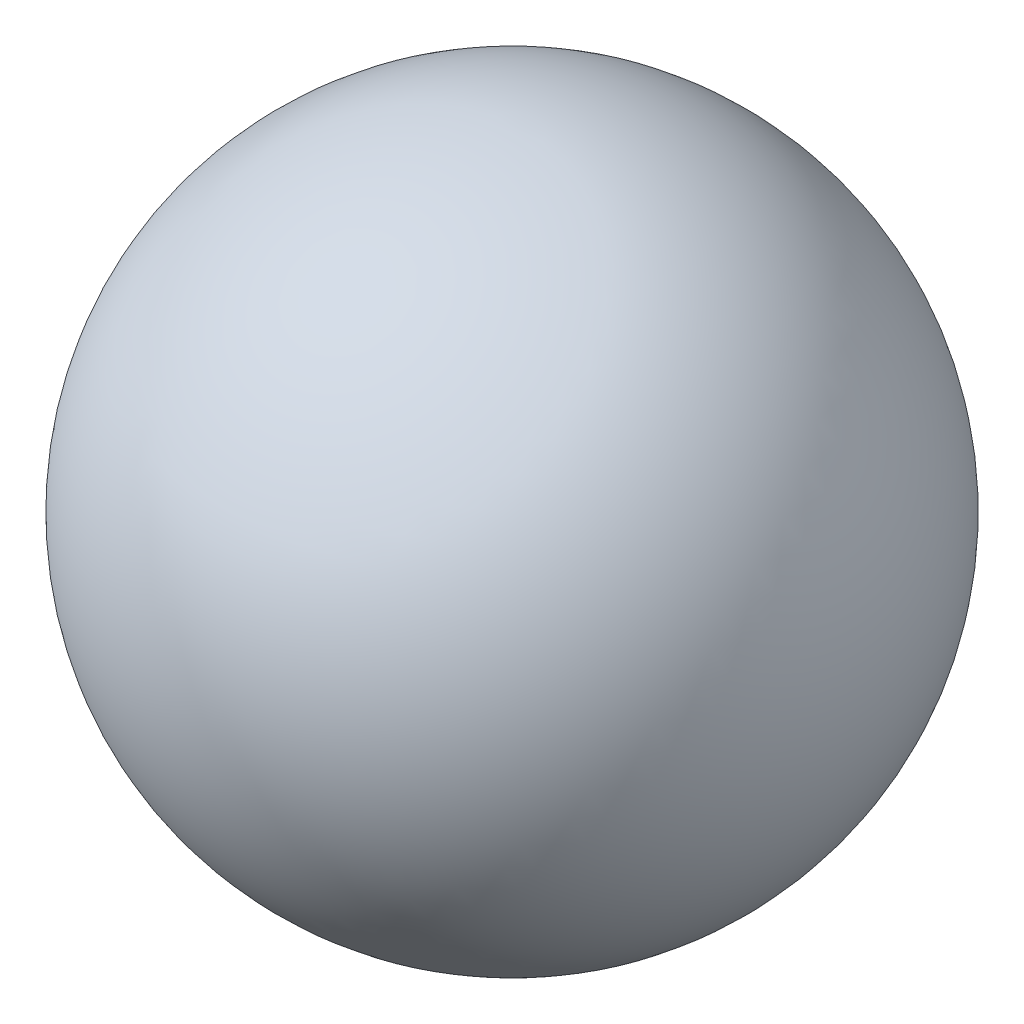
from build123d import *


with BuildPart() as part:
    # Sketch1 → Revolve1 (revolve)
    with BuildSketch(Plane.XY):
        with BuildLine():
            Line((0, 9.652), (0, -9.652))
            ThreePointArc((0, -9.652), (9.652, 0), (0, 9.652))
        make_face()
    revolve(axis=Axis((0, 9.652, 0), (0, -1, 0)))


solid = part.part
